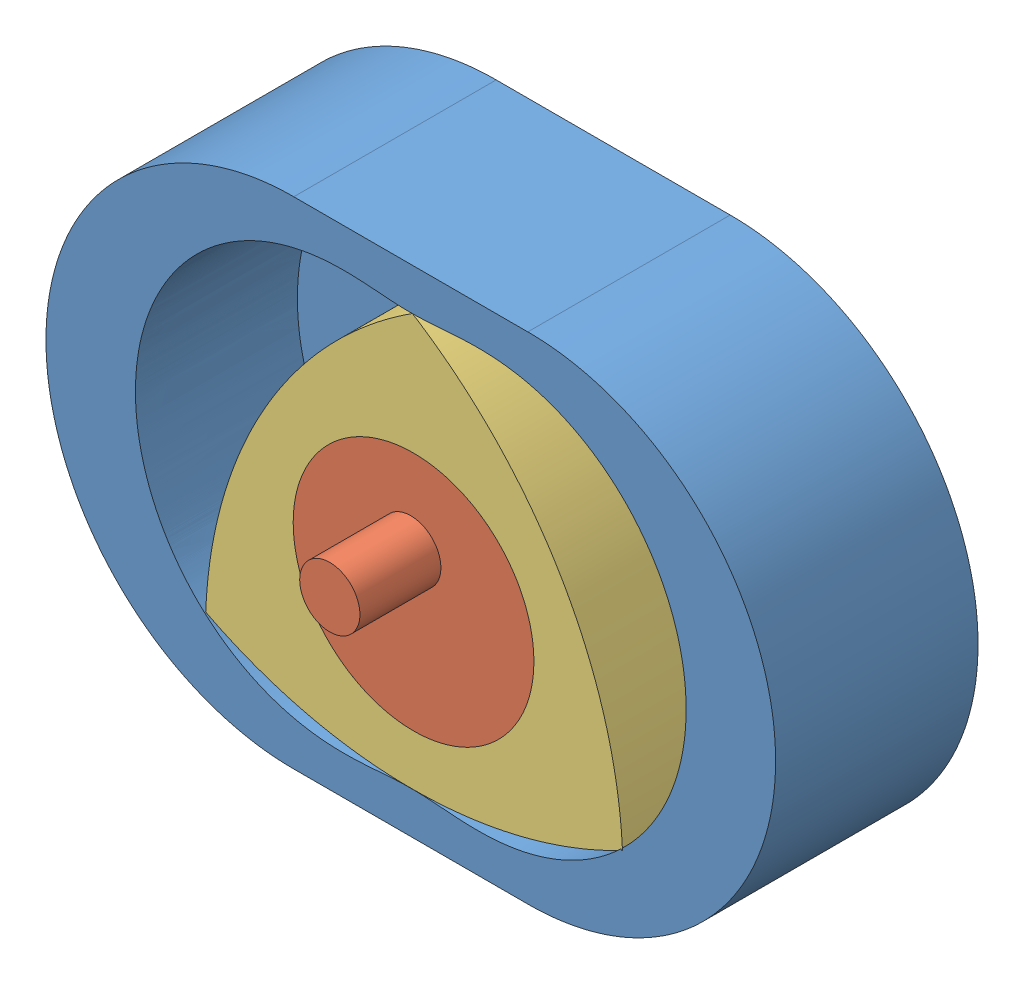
SolidWorks assembly ConcaveAssem.SLDASM, configuration Default (file format 11000). Lengths in mm.
Overall size (800.99 544.07 444.5).
3 component instances, 3 part files, 4 mates.
Components (placement in the parent):
- EnHousing-1: EnHousing.SLDPRT [Default] at (7.8867 -26.8864 695.198) size (800.99 544.07 222.25)
- Eshaft-1: Eshaft.SLDPRT [Default] at (10.9105 -64.8663 695.198) x (-0.996846 -0.079364 0) z (0 0 1) size (264.16 264.16 444.5)
- Rotor-1: Rotor.SLDPRT [Default] at (10.9105 -64.8663 695.198) x (0.999989 0.004711 0) z (0 0 1) size (457.54 452.12 177.8)
Mates (geometry in assembly coordinates):
- Coincident5: coincident: axis of EnHousing-1 through (7.8867 -26.8864 872.998) axis (0 0 -1); axis of Eshaft-1 through (7.8867 -26.8864 517.398) axis (0 0 1)
- Coincident6: coincident: axis of Eshaft-1 through (10.9105 -64.8663 872.998) axis (0 0 -1); axis of Rotor-1 through (10.9105 -64.8663 872.998) axis (0 0 -1)
- Coincident9: coincident: plane of EnHousing-1 through (-120.5738 -26.8864 695.198) normal (0 0 1); plane of Rotor-1 through (144.028 12.8276 695.198) normal (0 0 -1)
- Coincident10: coincident: plane of EnHousing-1 through (-120.5738 -26.8864 695.198) normal (0 0 1); plane of Eshaft-1 through (10.9105 -64.8663 695.198) normal (0 0 -1)
